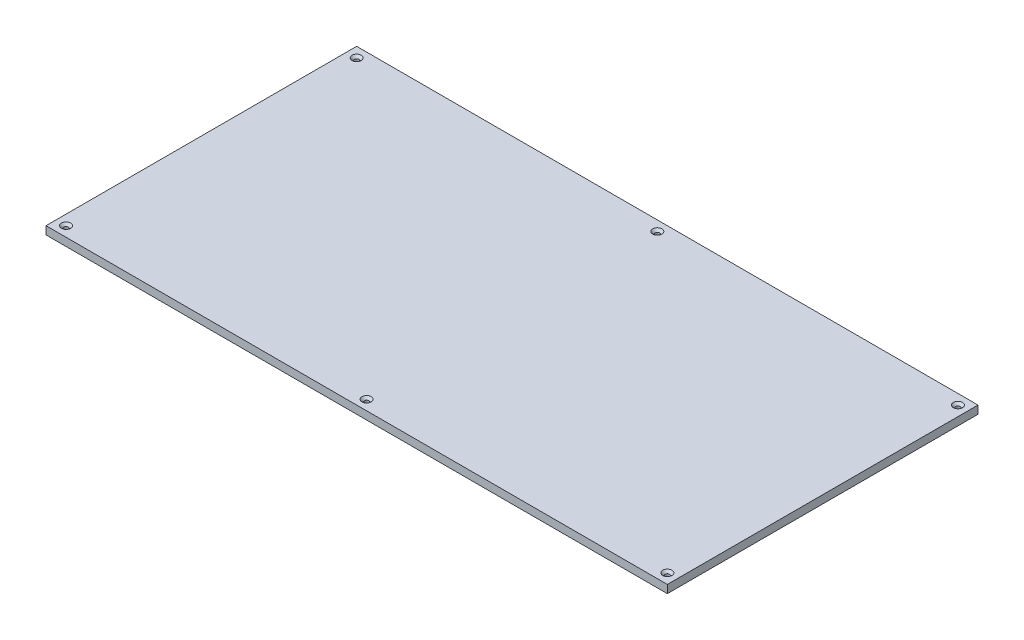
from build123d import *

# Parameters (mm, degrees)
SKIZZE1_W                                            = 620
SKIZZE1_H                                            = 310
AUFSATZ_LINEAR_AUSTRAGEN1_DEPTH                      = 8
FORMSENKUNG_F_R_M4_SENKSCHRAUBE_MIT_INNE_D           = 4.5
FORMSENKUNG_F_R_M4_SENKSCHRAUBE_MIT_INNE_CSINK_D     = 9.2
FORMSENKUNG_F_R_M4_SENKSCHRAUBE_MIT_INNE_CSINK_ANGLE = 90


with BuildPart() as part:
    # Skizze1 → Aufsatz-Linear austragen1 (new body)
    with BuildSketch(Plane(origin=(0, 0, 0), x_dir=(1, 0, 0), z_dir=(0, 1, 0))):
        Rectangle(SKIZZE1_W, SKIZZE1_H)
    extrude(amount=AUFSATZ_LINEAR_AUSTRAGEN1_DEPTH)

    # Formsenkung f_r M4 Senkschraube mit Inne (through all)
    with Locations(Plane(origin=(0, 8, 0), x_dir=(1, 0, 0), z_dir=(0, 1, 0))):
        with Locations((-300, -145), (0, -145), (300, -145), (300, 145), (0, 145), (-300, 145)):
            CounterSinkHole(FORMSENKUNG_F_R_M4_SENKSCHRAUBE_MIT_INNE_D / 2, FORMSENKUNG_F_R_M4_SENKSCHRAUBE_MIT_INNE_CSINK_D / 2, counter_sink_angle=FORMSENKUNG_F_R_M4_SENKSCHRAUBE_MIT_INNE_CSINK_ANGLE)


solid = part.part
